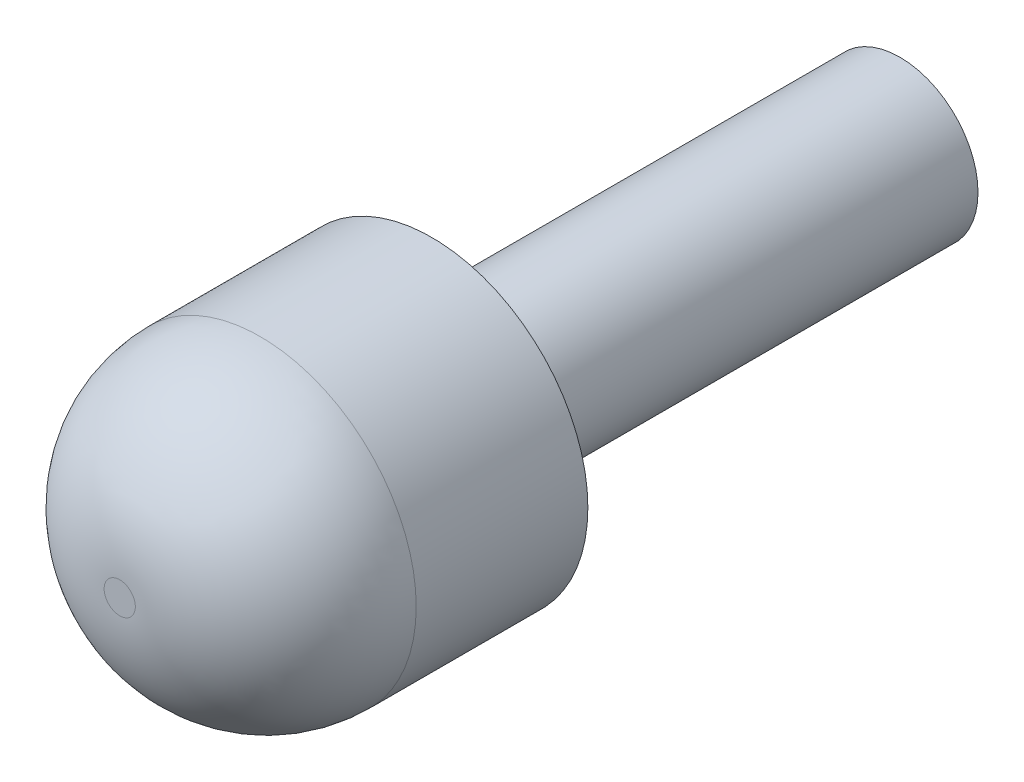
from build123d import *

# Parameters (mm, degrees)
SKETCH1_R           = 2
BASE_EXTRUDE_DEPTH  = 4
FILLET1_R           = 1.8
SKETCH2_R           = 1
BOSS_EXTRUDE1_DEPTH = 6
SKETCH3_W           = 1
SKETCH3_H           = 1
CUT_EXTRUDE1_DEPTH  = 1


with BuildPart() as part:
    # Sketch1 → Base-Extrude (new body)
    with BuildSketch(Plane.XY):
        Circle(SKETCH1_R)
    extrude(amount=-BASE_EXTRUDE_DEPTH)

    # Fillet1
    fillet1_edges = [part.edges().sort_by_distance(p)[0] for p in [
        (-2, 0, 0),
    ]]
    fillet(fillet1_edges, radius=FILLET1_R)

    # Sketch2 → Boss-Extrude1 (add)
    with BuildSketch(Plane(origin=(0, 0, -4), x_dir=(-1, 0, 0), z_dir=(0, 0, -1))):
        with Locations(Location((0, 0, 0), (0, 0, 180))):
            Circle(SKETCH2_R)
    extrude(amount=BOSS_EXTRUDE1_DEPTH)

    # Sketch3 → Cut-Extrude1 (cut)
    with BuildSketch(Plane(origin=(0, 0, -10), x_dir=(-1, 0, 0), z_dir=(0, 0, -1))):
        Rectangle(SKETCH3_W, SKETCH3_H)
    extrude(amount=-CUT_EXTRUDE1_DEPTH, mode=Mode.SUBTRACT)


solid = part.part
